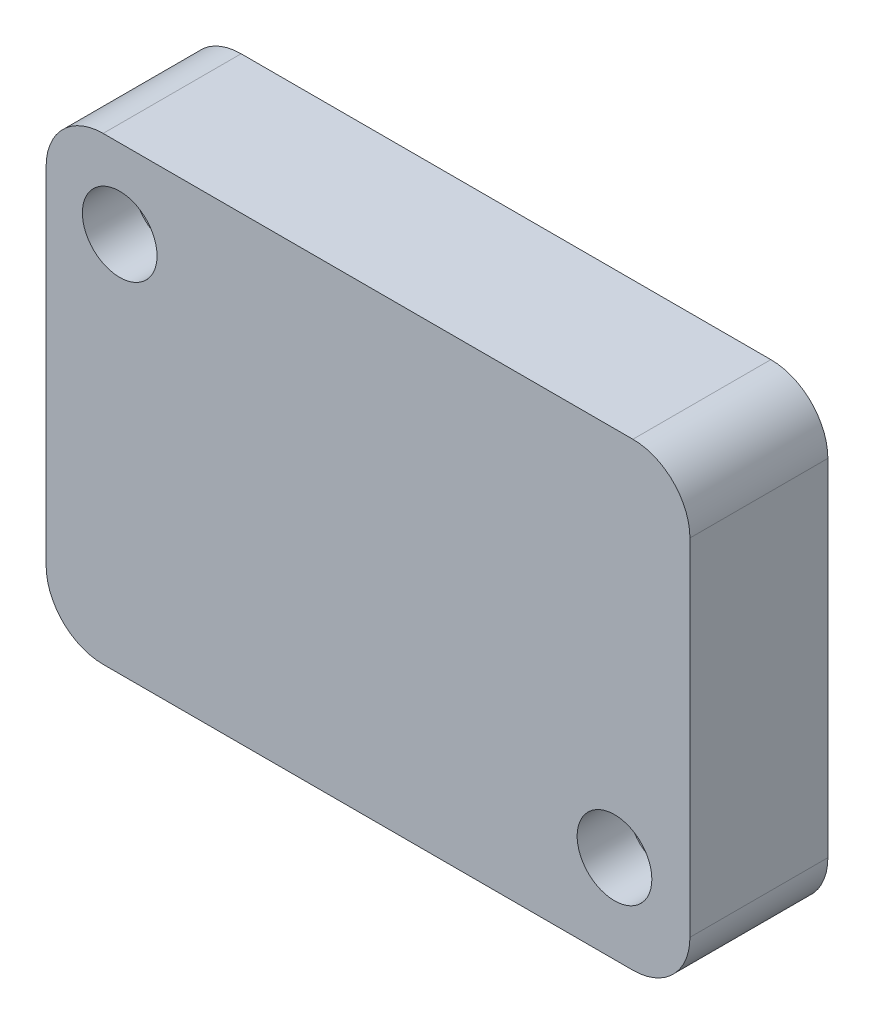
from build123d import *

# Parameters (mm, degrees)
DIE_DEPTH                                      = 19.05
DRILL_CBORE_FOR_1_4_SHCS_SHALLOW_1_D           = 7.1374
DRILL_CBORE_FOR_1_4_SHCS_SHALLOW_1_CBORE_D     = 10.3124
DRILL_CBORE_FOR_1_4_SHCS_SHALLOW_1_CBORE_DEPTH = 7.112


with BuildPart() as part:
    # Sketch1 → Die (new body)
    with BuildSketch(Plane.XY):
        with BuildLine():
            Line((-81.026, 63.5), (-7.874, 63.5))
            ThreePointArc((-7.874, 63.5), (-2.306241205, 61.193758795), (0, 55.626))
            Line((0, 55.626), (0, 7.874))
            ThreePointArc((0, 7.874), (-2.306241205, 2.306241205), (-7.874, 0))
            Line((-7.874, 0), (-81.026, 0))
            ThreePointArc((-81.026, 0), (-86.593758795, 2.306241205), (-88.9, 7.874))
            Line((-88.9, 7.874), (-88.9, 55.626))
            ThreePointArc((-88.9, 55.626), (-86.593758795, 61.193758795), (-81.026, 63.5))
        make_face()
    extrude(amount=DIE_DEPTH)

    # Drill_CBore For 1_4 SHCS _Shallow_1 (through all)
    with Locations(Plane.XY.offset(19.05)):
        with Locations((-10.414, 12.192), (-78.74, 52.578)):
            CounterBoreHole(DRILL_CBORE_FOR_1_4_SHCS_SHALLOW_1_D / 2, DRILL_CBORE_FOR_1_4_SHCS_SHALLOW_1_CBORE_D / 2, DRILL_CBORE_FOR_1_4_SHCS_SHALLOW_1_CBORE_DEPTH)


solid = part.part
